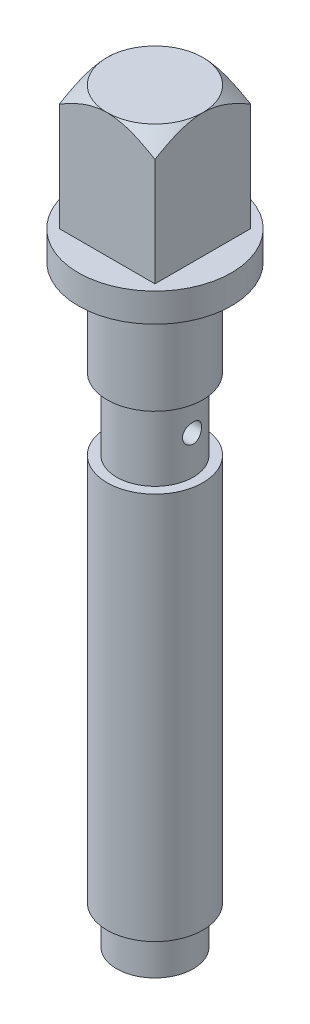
ISO-10303-21;
HEADER;
FILE_DESCRIPTION(('STEP AP214'),'2;1');
FILE_NAME('part.step','',(''),(''),'','','');
FILE_SCHEMA(('AUTOMOTIVE_DESIGN { 1 0 10303 214 1 1 1 1 }'));
ENDSEC;
DATA;
#1=APPLICATION_CONTEXT('core data for automotive mechanical design processes');
#2=APPLICATION_PROTOCOL_DEFINITION('international standard','automotive_design',2000,#1);
#3=PRODUCT_CONTEXT('',#1,'mechanical');
#4=PRODUCT('Part','Part','',(#3));
#5=PRODUCT_RELATED_PRODUCT_CATEGORY('part','',(#4));
#6=PRODUCT_DEFINITION_FORMATION('','',#4);
#7=PRODUCT_DEFINITION_CONTEXT('part definition',#1,'design');
#8=PRODUCT_DEFINITION('design','',#6,#7);
#9=PRODUCT_DEFINITION_SHAPE('','',#8);
#10=(LENGTH_UNIT() NAMED_UNIT(*) SI_UNIT(.MILLI.,.METRE.));
#11=(NAMED_UNIT(*) PLANE_ANGLE_UNIT() SI_UNIT($,.RADIAN.));
#12=(NAMED_UNIT(*) SI_UNIT($,.STERADIAN.) SOLID_ANGLE_UNIT());
#13=UNCERTAINTY_MEASURE_WITH_UNIT(LENGTH_MEASURE(1.E-05),#10,'distance_accuracy_value','');
#14=(GEOMETRIC_REPRESENTATION_CONTEXT(3) GLOBAL_UNCERTAINTY_ASSIGNED_CONTEXT((#13)) GLOBAL_UNIT_ASSIGNED_CONTEXT((#10,
#11,#12)) REPRESENTATION_CONTEXT('',''));
#15=CARTESIAN_POINT('',(0.,0.,0.));
#16=DIRECTION('',(0.,0.,1.));
#17=DIRECTION('',(1.,0.,0.));
#18=AXIS2_PLACEMENT_3D('',#15,#16,#17);
#19=CARTESIAN_POINT('',(5.,78.,-5.));
#20=DIRECTION('',(-1.,0.,0.));
#21=DIRECTION('',(0.,0.,1.));
#22=AXIS2_PLACEMENT_3D('',#19,#20,#21);
#23=PLANE('',#22);
#24=CARTESIAN_POINT('',(5.,68.7702588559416,15.1982390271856));
#25=CARTESIAN_POINT('',(5.,68.99079490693,14.9215460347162));
#26=CARTESIAN_POINT('',(5.,69.2109817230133,14.6445739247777));
#27=CARTESIAN_POINT('',(5.,69.6505101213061,14.0899565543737));
#28=CARTESIAN_POINT('',(5.,69.8698516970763,13.812311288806));
#29=CARTESIAN_POINT('',(5.,70.3076216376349,13.2561325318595));
#30=CARTESIAN_POINT('',(5.,70.5260496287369,12.9775987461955));
#31=CARTESIAN_POINT('',(5.,70.9617119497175,12.4195998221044));
#32=CARTESIAN_POINT('',(5.,71.1789462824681,12.1401346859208));
#33=CARTESIAN_POINT('',(5.,71.6139884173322,11.5774819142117));
#34=CARTESIAN_POINT('',(5.,71.8317827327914,11.2942838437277));
#35=CARTESIAN_POINT('',(5.,72.2655688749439,10.7265105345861));
#36=CARTESIAN_POINT('',(5.,72.4815607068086,10.4419352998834));
#37=CARTESIAN_POINT('',(5.,72.9112520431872,9.87115979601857));
#38=CARTESIAN_POINT('',(5.,73.1249520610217,9.58495991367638));
#39=CARTESIAN_POINT('',(5.,73.5495167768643,9.01046470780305));
#40=CARTESIAN_POINT('',(5.,73.7603815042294,8.72216940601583));
#41=CARTESIAN_POINT('',(5.,74.1146077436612,8.23138402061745));
#42=CARTESIAN_POINT('',(5.,74.2589172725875,8.02957850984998));
#43=CARTESIAN_POINT('',(5.,74.5453944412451,7.62445390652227));
#44=CARTESIAN_POINT('',(5.,74.6875621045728,7.42113483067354));
#45=CARTESIAN_POINT('',(5.,74.9693599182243,7.01257694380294));
#46=CARTESIAN_POINT('',(5.,75.1089886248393,6.80733713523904));
#47=CARTESIAN_POINT('',(5.,75.3850015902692,6.39468729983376));
#48=CARTESIAN_POINT('',(5.,75.5213859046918,6.18727731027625));
#49=CARTESIAN_POINT('',(5.,75.7900281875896,5.76991687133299));
#50=CARTESIAN_POINT('',(5.,75.9222878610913,5.55996752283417));
#51=CARTESIAN_POINT('',(5.,76.1816386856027,5.13686009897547));
#52=CARTESIAN_POINT('',(5.,76.3087293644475,4.92370173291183));
#53=CARTESIAN_POINT('',(5.,76.556100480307,4.49369278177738));
#54=CARTESIAN_POINT('',(5.,76.6763866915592,4.27684553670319));
#55=CARTESIAN_POINT('',(5.,76.9081538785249,3.83852099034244));
#56=CARTESIAN_POINT('',(5.,77.0196370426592,3.61704485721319));
#57=CARTESIAN_POINT('',(5.,77.2189336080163,3.19403753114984));
#58=CARTESIAN_POINT('',(5.,77.3079971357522,2.99310006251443));
#59=CARTESIAN_POINT('',(5.,77.4743093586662,2.5863054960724));
#60=CARTESIAN_POINT('',(5.,77.5515568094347,2.38044788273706));
#61=CARTESIAN_POINT('',(5.,77.6904961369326,1.96485418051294));
#62=CARTESIAN_POINT('',(5.,77.7522793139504,1.75514909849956));
#63=CARTESIAN_POINT('',(5.,77.8571911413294,1.33109634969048));
#64=CARTESIAN_POINT('',(5.,77.9003275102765,1.11675064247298));
#65=CARTESIAN_POINT('',(5.,77.9589438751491,0.722759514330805));
#66=CARTESIAN_POINT('',(5.,77.9779540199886,0.543642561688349));
#67=CARTESIAN_POINT('',(5.,77.9998354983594,0.184429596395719));
#68=CARTESIAN_POINT('',(5.,78.0027095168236,0.00433375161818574));
#69=CARTESIAN_POINT('',(5.,77.9921156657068,-0.355588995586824));
#70=CARTESIAN_POINT('',(5.,77.978627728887,-0.535415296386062));
#71=CARTESIAN_POINT('',(5.,77.936173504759,-0.893230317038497));
#72=CARTESIAN_POINT('',(5.,77.9072035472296,-1.07121859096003));
#73=CARTESIAN_POINT('',(5.,77.8197601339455,-1.50158385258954));
#74=CARTESIAN_POINT('',(5.,77.7539250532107,-1.75245979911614));
#75=CARTESIAN_POINT('',(5.,77.5997987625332,-2.24719652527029));
#76=CARTESIAN_POINT('',(5.,77.5114915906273,-2.49105218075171));
#77=CARTESIAN_POINT('',(5.,77.365756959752,-2.85330227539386));
#78=CARTESIAN_POINT('',(5.,77.3145714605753,-2.9742747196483));
#79=CARTESIAN_POINT('',(5.,77.2084614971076,-3.21457428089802));
#80=CARTESIAN_POINT('',(5.,77.1535369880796,-3.33390137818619));
#81=CARTESIAN_POINT('',(5.,77.0405051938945,-3.57097684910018));
#82=CARTESIAN_POINT('',(5.,76.9823990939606,-3.68872579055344));
#83=CARTESIAN_POINT('',(5.,76.8634311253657,-3.9228121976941));
#84=CARTESIAN_POINT('',(5.,76.8025693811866,-4.03914972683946));
#85=CARTESIAN_POINT('',(5.,76.5982841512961,-4.42010551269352));
#86=CARTESIAN_POINT('',(5.,76.4498235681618,-4.68202621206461));
#87=CARTESIAN_POINT('',(5.,76.1439447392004,-5.20060577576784));
#88=CARTESIAN_POINT('',(5.,75.9865242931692,-5.45726332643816));
#89=CARTESIAN_POINT('',(5.,75.6649423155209,-5.96660078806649));
#90=CARTESIAN_POINT('',(5.,75.5007753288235,-6.21927724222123));
#91=CARTESIAN_POINT('',(5.,75.1674653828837,-6.72127926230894));
#92=CARTESIAN_POINT('',(5.,74.9983228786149,-6.97060513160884));
#93=CARTESIAN_POINT('',(5.,74.6556032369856,-7.46744999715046));
#94=CARTESIAN_POINT('',(5.,74.4820128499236,-7.71495983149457));
#95=CARTESIAN_POINT('',(5.,74.1317912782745,-8.20782145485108));
#96=CARTESIAN_POINT('',(5.,73.9551600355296,-8.4531732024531));
#97=CARTESIAN_POINT('',(5.,73.5995587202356,-8.94199727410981));
#98=CARTESIAN_POINT('',(5.,73.4205897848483,-9.18547042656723));
#99=CARTESIAN_POINT('',(5.,73.0606889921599,-9.67096254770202));
#100=CARTESIAN_POINT('',(5.,72.879757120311,-9.91298150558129));
#101=CARTESIAN_POINT('',(5.,72.3765519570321,-10.5814474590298));
#102=CARTESIAN_POINT('',(5.,72.0525743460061,-11.0066111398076));
#103=CARTESIAN_POINT('',(5.,71.4009604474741,-11.8542074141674));
#104=CARTESIAN_POINT('',(5.,71.073323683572,-12.2766396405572));
#105=CARTESIAN_POINT('',(5.,70.4175726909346,-13.116543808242));
#106=CARTESIAN_POINT('',(5.,70.0894766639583,-13.5340299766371));
#107=CARTESIAN_POINT('',(5.,69.4312561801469,-14.367290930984));
#108=CARTESIAN_POINT('',(5.,69.1011320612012,-14.7830659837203));
#109=CARTESIAN_POINT('',(5.,68.7702588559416,-15.1982390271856));
#110=B_SPLINE_CURVE_WITH_KNOTS('',3,(#24,#25,#26,#27,#28,#29,#30,#31,#32,#33,#34,#35,#36,#37,
#38,#39,#40,#41,#42,#43,#44,#45,#46,#47,#48,#49,#50,#51,#52,#53,#54,#55,#56,#57,#58,#59,#60,#61,
#62,#63,#64,#65,#66,#67,#68,#69,#70,#71,#72,#73,#74,#75,#76,#77,#78,#79,#80,#81,#82,#83,#84,#85,
#86,#87,#88,#89,#90,#91,#92,#93,#94,#95,#96,#97,#98,#99,#100,#101,#102,#103,#104,#105,#106,#107,
#108,#109),.UNSPECIFIED.,.F.,.F.,(4,2,2,2,2,2,2,2,2,2,2,2,2,2,2,2,2,2,2,2,2,2,2,2,2,2,2,2,2,2,2,
2,2,2,2,2,2,2,2,2,2,2,4),(0.,1.06148845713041,2.12298498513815,3.18487995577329,
4.24677237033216,5.31854997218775,6.39032449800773,7.46185373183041,8.53337186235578,
9.27764330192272,10.0219065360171,10.7665805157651,11.5112417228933,12.2555909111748,
13.0000079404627,13.7437834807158,14.487373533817,15.1464592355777,15.8056143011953,
16.4607807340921,17.11567570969,17.6553711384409,18.1949767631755,18.7352448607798,
19.2756410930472,20.0523146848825,20.8295414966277,21.2235583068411,21.61757983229,
22.0114555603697,22.4053135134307,23.3082380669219,24.2113853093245,25.1152777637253,
26.019087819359,26.9260059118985,27.8329413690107,28.7394509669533,29.6459672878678,
31.2495362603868,32.8533164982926,34.4462545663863,36.0389340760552),.UNSPECIFIED.);
#111=CARTESIAN_POINT('',(5.,76.2621677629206,5.));
#112=VERTEX_POINT('',#111);
#113=CARTESIAN_POINT('',(5.,78.,0.));
#114=VERTEX_POINT('',#113);
#115=EDGE_CURVE('E105',#112,#114,#110,.T.);
#116=ORIENTED_EDGE('',*,*,#115,.F.);
#117=DIRECTION('',(0.,-1.,0.));
#118=VECTOR('',#117,1.);
#119=CARTESIAN_POINT('',(5.,78.,5.));
#120=LINE('',#119,#118);
#121=CARTESIAN_POINT('',(5.,65.,5.));
#122=VERTEX_POINT('',#121);
#123=EDGE_CURVE('E72',#112,#122,#120,.T.);
#124=ORIENTED_EDGE('',*,*,#123,.T.);
#125=DIRECTION('',(0.,0.,-1.));
#126=VECTOR('',#125,1.);
#127=CARTESIAN_POINT('',(5.,65.,-5.));
#128=LINE('',#127,#126);
#129=CARTESIAN_POINT('',(5.,65.,-5.));
#130=VERTEX_POINT('',#129);
#131=EDGE_CURVE('E113',#122,#130,#128,.T.);
#132=ORIENTED_EDGE('',*,*,#131,.T.);
#133=DIRECTION('',(0.,-1.,0.));
#134=VECTOR('',#133,1.);
#135=CARTESIAN_POINT('',(5.,78.,-5.));
#136=LINE('',#135,#134);
#137=CARTESIAN_POINT('',(5.,76.2621677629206,-5.));
#138=VERTEX_POINT('',#137);
#139=EDGE_CURVE('E126',#138,#130,#136,.T.);
#140=ORIENTED_EDGE('',*,*,#139,.F.);
#141=EDGE_CURVE('E114',#114,#138,#110,.T.);
#142=ORIENTED_EDGE('',*,*,#141,.F.);
#143=EDGE_LOOP('',(#116,#124,#132,#140,#142));
#144=FACE_BOUND('',#143,.T.);
#145=ADVANCED_FACE('F48',(#144),#23,.F.);
#146=CARTESIAN_POINT('',(-5.,78.,-5.));
#147=DIRECTION('',(0.,0.,1.));
#148=DIRECTION('',(1.,0.,0.));
#149=AXIS2_PLACEMENT_3D('',#146,#147,#148);
#150=PLANE('',#149);
#151=CARTESIAN_POINT('',(15.1982390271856,68.7702588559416,-5.));
#152=CARTESIAN_POINT('',(14.9215460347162,68.99079490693,-5.));
#153=CARTESIAN_POINT('',(14.6445739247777,69.2109817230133,-5.));
#154=CARTESIAN_POINT('',(14.0899565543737,69.6505101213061,-5.));
#155=CARTESIAN_POINT('',(13.812311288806,69.8698516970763,-5.));
#156=CARTESIAN_POINT('',(13.2561325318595,70.3076216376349,-5.));
#157=CARTESIAN_POINT('',(12.9775987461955,70.5260496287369,-5.));
#158=CARTESIAN_POINT('',(12.4195998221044,70.9617119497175,-5.));
#159=CARTESIAN_POINT('',(12.1401346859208,71.1789462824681,-5.));
#160=CARTESIAN_POINT('',(11.5774819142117,71.6139884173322,-5.));
#161=CARTESIAN_POINT('',(11.2942838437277,71.8317827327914,-5.));
#162=CARTESIAN_POINT('',(10.7265105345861,72.2655688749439,-5.));
#163=CARTESIAN_POINT('',(10.4419352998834,72.4815607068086,-5.));
#164=CARTESIAN_POINT('',(9.87115979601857,72.9112520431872,-5.));
#165=CARTESIAN_POINT('',(9.58495991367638,73.1249520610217,-5.));
#166=CARTESIAN_POINT('',(9.01046470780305,73.5495167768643,-5.));
#167=CARTESIAN_POINT('',(8.72216940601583,73.7603815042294,-5.));
#168=CARTESIAN_POINT('',(8.23138402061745,74.1146077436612,-5.));
#169=CARTESIAN_POINT('',(8.02957850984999,74.2589172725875,-5.));
#170=CARTESIAN_POINT('',(7.62445390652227,74.5453944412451,-5.));
#171=CARTESIAN_POINT('',(7.42113483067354,74.6875621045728,-5.));
#172=CARTESIAN_POINT('',(7.01257694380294,74.9693599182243,-5.));
#173=CARTESIAN_POINT('',(6.80733713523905,75.1089886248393,-5.));
#174=CARTESIAN_POINT('',(6.39468729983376,75.3850015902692,-5.));
#175=CARTESIAN_POINT('',(6.18727731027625,75.5213859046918,-5.));
#176=CARTESIAN_POINT('',(5.769916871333,75.7900281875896,-5.));
#177=CARTESIAN_POINT('',(5.55996752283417,75.9222878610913,-5.));
#178=CARTESIAN_POINT('',(5.13686009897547,76.1816386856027,-5.));
#179=CARTESIAN_POINT('',(4.92370173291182,76.3087293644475,-5.));
#180=CARTESIAN_POINT('',(4.49369278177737,76.556100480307,-5.));
#181=CARTESIAN_POINT('',(4.27684553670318,76.6763866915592,-5.));
#182=CARTESIAN_POINT('',(3.83852099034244,76.9081538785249,-5.));
#183=CARTESIAN_POINT('',(3.61704485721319,77.0196370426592,-5.));
#184=CARTESIAN_POINT('',(3.19403753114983,77.2189336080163,-5.));
#185=CARTESIAN_POINT('',(2.99310006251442,77.3079971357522,-5.));
#186=CARTESIAN_POINT('',(2.58630549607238,77.4743093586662,-5.));
#187=CARTESIAN_POINT('',(2.38044788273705,77.5515568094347,-5.));
#188=CARTESIAN_POINT('',(1.96485418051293,77.6904961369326,-5.));
#189=CARTESIAN_POINT('',(1.75514909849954,77.7522793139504,-5.));
#190=CARTESIAN_POINT('',(1.33109634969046,77.8571911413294,-5.));
#191=CARTESIAN_POINT('',(1.11675064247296,77.9003275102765,-5.));
#192=CARTESIAN_POINT('',(0.722759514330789,77.9589438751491,-5.));
#193=CARTESIAN_POINT('',(0.543642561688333,77.9779540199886,-5.));
#194=CARTESIAN_POINT('',(0.184429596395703,77.9998354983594,-5.));
#195=CARTESIAN_POINT('',(0.0043337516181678,78.0027095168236,-5.));
#196=CARTESIAN_POINT('',(-0.355588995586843,77.9921156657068,-5.));
#197=CARTESIAN_POINT('',(-0.535415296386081,77.978627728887,-5.));
#198=CARTESIAN_POINT('',(-0.893230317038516,77.936173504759,-5.));
#199=CARTESIAN_POINT('',(-1.07121859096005,77.9072035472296,-5.));
#200=CARTESIAN_POINT('',(-1.50158385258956,77.8197601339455,-5.));
#201=CARTESIAN_POINT('',(-1.75245979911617,77.7539250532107,-5.));
#202=CARTESIAN_POINT('',(-2.24719652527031,77.5997987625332,-5.));
#203=CARTESIAN_POINT('',(-2.49105218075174,77.5114915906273,-5.));
#204=CARTESIAN_POINT('',(-2.85330227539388,77.365756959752,-5.));
#205=CARTESIAN_POINT('',(-2.97427471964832,77.3145714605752,-5.));
#206=CARTESIAN_POINT('',(-3.21457428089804,77.2084614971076,-5.));
#207=CARTESIAN_POINT('',(-3.33390137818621,77.1535369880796,-5.));
#208=CARTESIAN_POINT('',(-3.5709768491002,77.0405051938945,-5.));
#209=CARTESIAN_POINT('',(-3.68872579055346,76.9823990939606,-5.));
#210=CARTESIAN_POINT('',(-3.92281219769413,76.8634311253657,-5.));
#211=CARTESIAN_POINT('',(-4.03914972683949,76.8025693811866,-5.));
#212=CARTESIAN_POINT('',(-4.42010551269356,76.5982841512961,-5.));
#213=CARTESIAN_POINT('',(-4.68202621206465,76.4498235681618,-5.));
#214=CARTESIAN_POINT('',(-5.20060577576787,76.1439447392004,-5.));
#215=CARTESIAN_POINT('',(-5.45726332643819,75.9865242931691,-5.));
#216=CARTESIAN_POINT('',(-5.96660078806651,75.6649423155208,-5.));
#217=CARTESIAN_POINT('',(-6.21927724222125,75.5007753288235,-5.));
#218=CARTESIAN_POINT('',(-6.72127926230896,75.1674653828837,-5.));
#219=CARTESIAN_POINT('',(-6.97060513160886,74.9983228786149,-5.));
#220=CARTESIAN_POINT('',(-7.46744999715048,74.6556032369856,-5.));
#221=CARTESIAN_POINT('',(-7.71495983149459,74.4820128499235,-5.));
#222=CARTESIAN_POINT('',(-8.2078214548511,74.1317912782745,-5.));
#223=CARTESIAN_POINT('',(-8.45317320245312,73.9551600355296,-5.));
#224=CARTESIAN_POINT('',(-8.94199727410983,73.5995587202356,-5.));
#225=CARTESIAN_POINT('',(-9.18547042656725,73.4205897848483,-5.));
#226=CARTESIAN_POINT('',(-9.67096254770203,73.0606889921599,-5.));
#227=CARTESIAN_POINT('',(-9.91298150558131,72.879757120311,-5.));
#228=CARTESIAN_POINT('',(-10.5814474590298,72.3765519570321,-5.));
#229=CARTESIAN_POINT('',(-11.0066111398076,72.0525743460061,-5.));
#230=CARTESIAN_POINT('',(-11.8542074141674,71.4009604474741,-5.));
#231=CARTESIAN_POINT('',(-12.2766396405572,71.073323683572,-5.));
#232=CARTESIAN_POINT('',(-13.116543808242,70.4175726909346,-5.));
#233=CARTESIAN_POINT('',(-13.5340299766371,70.0894766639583,-5.));
#234=CARTESIAN_POINT('',(-14.367290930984,69.4312561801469,-5.));
#235=CARTESIAN_POINT('',(-14.7830659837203,69.1011320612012,-5.));
#236=CARTESIAN_POINT('',(-15.1982390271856,68.7702588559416,-5.));
#237=B_SPLINE_CURVE_WITH_KNOTS('',3,(#151,#152,#153,#154,#155,#156,#157,#158,#159,#160,#161,
#162,#163,#164,#165,#166,#167,#168,#169,#170,#171,#172,#173,#174,#175,#176,#177,#178,#179,#180,
#181,#182,#183,#184,#185,#186,#187,#188,#189,#190,#191,#192,#193,#194,#195,#196,#197,#198,#199,
#200,#201,#202,#203,#204,#205,#206,#207,#208,#209,#210,#211,#212,#213,#214,#215,#216,#217,#218,
#219,#220,#221,#222,#223,#224,#225,#226,#227,#228,#229,#230,#231,#232,#233,#234,#235,#236),
.UNSPECIFIED.,.F.,.F.,(4,2,2,2,2,2,2,2,2,2,2,2,2,2,2,2,2,2,2,2,2,2,2,2,2,2,2,2,2,2,2,2,2,2,2,2,
2,2,2,2,2,2,4),(0.,1.06148845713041,2.12298498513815,3.18487995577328,4.24677237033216,
5.31854997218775,6.39032449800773,7.46185373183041,8.53337186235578,9.27764330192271,
10.0219065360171,10.7665805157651,11.5112417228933,12.2555909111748,13.0000079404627,
13.7437834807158,14.487373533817,15.1464592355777,15.8056143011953,16.4607807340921,
17.11567570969,17.6553711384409,18.1949767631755,18.7352448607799,19.2756410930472,
20.0523146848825,20.8295414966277,21.2235583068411,21.61757983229,22.0114555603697,
22.4053135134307,23.3082380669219,24.2113853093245,25.1152777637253,26.019087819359,
26.9260059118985,27.8329413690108,28.7394509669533,29.6459672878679,31.2495362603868,
32.8533164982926,34.4462545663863,36.0389340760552),.UNSPECIFIED.);
#238=CARTESIAN_POINT('',(0.,78.,-5.));
#239=VERTEX_POINT('',#238);
#240=EDGE_CURVE('E119',#138,#239,#237,.T.);
#241=ORIENTED_EDGE('',*,*,#240,.F.);
#242=ORIENTED_EDGE('',*,*,#139,.T.);
#243=DIRECTION('',(-1.,0.,0.));
#244=VECTOR('',#243,1.);
#245=CARTESIAN_POINT('',(-5.,65.,-5.));
#246=LINE('',#245,#244);
#247=CARTESIAN_POINT('',(-5.,65.,-5.));
#248=VERTEX_POINT('',#247);
#249=EDGE_CURVE('E302',#130,#248,#246,.T.);
#250=ORIENTED_EDGE('',*,*,#249,.T.);
#251=DIRECTION('',(0.,-1.,0.));
#252=VECTOR('',#251,1.);
#253=CARTESIAN_POINT('',(-5.,78.,-5.));
#254=LINE('',#253,#252);
#255=CARTESIAN_POINT('',(-5.,76.2621677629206,-5.));
#256=VERTEX_POINT('',#255);
#257=EDGE_CURVE('E185',#256,#248,#254,.T.);
#258=ORIENTED_EDGE('',*,*,#257,.F.);
#259=EDGE_CURVE('E129',#239,#256,#237,.T.);
#260=ORIENTED_EDGE('',*,*,#259,.F.);
#261=EDGE_LOOP('',(#241,#242,#250,#258,#260));
#262=FACE_BOUND('',#261,.T.);
#263=ADVANCED_FACE('F173',(#262),#150,.F.);
#264=CARTESIAN_POINT('',(-5.,78.,-5.));
#265=DIRECTION('',(1.,0.,0.));
#266=DIRECTION('',(0.,0.,-1.));
#267=AXIS2_PLACEMENT_3D('',#264,#265,#266);
#268=PLANE('',#267);
#269=CARTESIAN_POINT('',(-5.,68.7702588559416,-15.1982390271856));
#270=CARTESIAN_POINT('',(-5.,68.99079490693,-14.9215460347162));
#271=CARTESIAN_POINT('',(-5.,69.2109817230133,-14.6445739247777));
#272=CARTESIAN_POINT('',(-5.,69.6505101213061,-14.0899565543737));
#273=CARTESIAN_POINT('',(-5.,69.8698516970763,-13.812311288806));
#274=CARTESIAN_POINT('',(-5.,70.3076216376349,-13.2561325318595));
#275=CARTESIAN_POINT('',(-5.,70.5260496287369,-12.9775987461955));
#276=CARTESIAN_POINT('',(-5.,70.9617119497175,-12.4195998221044));
#277=CARTESIAN_POINT('',(-5.,71.1789462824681,-12.1401346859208));
#278=CARTESIAN_POINT('',(-5.,71.6139884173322,-11.5774819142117));
#279=CARTESIAN_POINT('',(-5.,71.8317827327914,-11.2942838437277));
#280=CARTESIAN_POINT('',(-5.,72.2655688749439,-10.7265105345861));
#281=CARTESIAN_POINT('',(-5.,72.4815607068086,-10.4419352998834));
#282=CARTESIAN_POINT('',(-5.,72.9112520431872,-9.87115979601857));
#283=CARTESIAN_POINT('',(-5.,73.1249520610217,-9.58495991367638));
#284=CARTESIAN_POINT('',(-5.,73.5495167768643,-9.01046470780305));
#285=CARTESIAN_POINT('',(-5.,73.7603815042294,-8.72216940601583));
#286=CARTESIAN_POINT('',(-5.,74.1146077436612,-8.23138402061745));
#287=CARTESIAN_POINT('',(-5.,74.2589172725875,-8.02957850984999));
#288=CARTESIAN_POINT('',(-5.,74.5453944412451,-7.62445390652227));
#289=CARTESIAN_POINT('',(-5.,74.6875621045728,-7.42113483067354));
#290=CARTESIAN_POINT('',(-5.,74.9693599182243,-7.01257694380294));
#291=CARTESIAN_POINT('',(-5.,75.1089886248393,-6.80733713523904));
#292=CARTESIAN_POINT('',(-5.,75.3850015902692,-6.39468729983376));
#293=CARTESIAN_POINT('',(-5.,75.5213859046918,-6.18727731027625));
#294=CARTESIAN_POINT('',(-5.,75.7900281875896,-5.76991687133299));
#295=CARTESIAN_POINT('',(-5.,75.9222878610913,-5.55996752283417));
#296=CARTESIAN_POINT('',(-5.,76.1816386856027,-5.13686009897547));
#297=CARTESIAN_POINT('',(-5.,76.3087293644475,-4.92370173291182));
#298=CARTESIAN_POINT('',(-5.,76.556100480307,-4.49369278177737));
#299=CARTESIAN_POINT('',(-5.,76.6763866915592,-4.27684553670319));
#300=CARTESIAN_POINT('',(-5.,76.9081538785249,-3.83852099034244));
#301=CARTESIAN_POINT('',(-5.,77.0196370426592,-3.61704485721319));
#302=CARTESIAN_POINT('',(-5.,77.2189336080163,-3.19403753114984));
#303=CARTESIAN_POINT('',(-5.,77.3079971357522,-2.99310006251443));
#304=CARTESIAN_POINT('',(-5.,77.4743093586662,-2.5863054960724));
#305=CARTESIAN_POINT('',(-5.,77.5515568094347,-2.38044788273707));
#306=CARTESIAN_POINT('',(-5.,77.6904961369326,-1.96485418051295));
#307=CARTESIAN_POINT('',(-5.,77.7522793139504,-1.75514909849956));
#308=CARTESIAN_POINT('',(-5.,77.8571911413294,-1.33109634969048));
#309=CARTESIAN_POINT('',(-5.,77.9003275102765,-1.11675064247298));
#310=CARTESIAN_POINT('',(-5.,77.9589438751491,-0.722759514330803));
#311=CARTESIAN_POINT('',(-5.,77.9779540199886,-0.543642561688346));
#312=CARTESIAN_POINT('',(-5.,77.9998354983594,-0.184429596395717));
#313=CARTESIAN_POINT('',(-5.,78.0027095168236,-0.00433375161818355));
#314=CARTESIAN_POINT('',(-5.,77.9921156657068,0.355588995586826));
#315=CARTESIAN_POINT('',(-5.,77.978627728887,0.535415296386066));
#316=CARTESIAN_POINT('',(-5.,77.936173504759,0.8932303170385));
#317=CARTESIAN_POINT('',(-5.,77.9072035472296,1.07121859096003));
#318=CARTESIAN_POINT('',(-5.,77.8197601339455,1.50158385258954));
#319=CARTESIAN_POINT('',(-5.,77.7539250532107,1.75245979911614));
#320=CARTESIAN_POINT('',(-5.,77.5997987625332,2.24719652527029));
#321=CARTESIAN_POINT('',(-5.,77.5114915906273,2.49105218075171));
#322=CARTESIAN_POINT('',(-5.,77.365756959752,2.85330227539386));
#323=CARTESIAN_POINT('',(-5.,77.3145714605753,2.9742747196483));
#324=CARTESIAN_POINT('',(-5.,77.2084614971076,3.21457428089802));
#325=CARTESIAN_POINT('',(-5.,77.1535369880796,3.33390137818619));
#326=CARTESIAN_POINT('',(-5.,77.0405051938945,3.57097684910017));
#327=CARTESIAN_POINT('',(-5.,76.9823990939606,3.68872579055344));
#328=CARTESIAN_POINT('',(-5.,76.8634311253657,3.9228121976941));
#329=CARTESIAN_POINT('',(-5.,76.8025693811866,4.03914972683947));
#330=CARTESIAN_POINT('',(-5.,76.5982841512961,4.42010551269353));
#331=CARTESIAN_POINT('',(-5.,76.4498235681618,4.68202621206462));
#332=CARTESIAN_POINT('',(-5.,76.1439447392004,5.20060577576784));
#333=CARTESIAN_POINT('',(-5.,75.9865242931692,5.45726332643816));
#334=CARTESIAN_POINT('',(-5.,75.6649423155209,5.96660078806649));
#335=CARTESIAN_POINT('',(-5.,75.5007753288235,6.21927724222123));
#336=CARTESIAN_POINT('',(-5.,75.1674653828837,6.72127926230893));
#337=CARTESIAN_POINT('',(-5.,74.9983228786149,6.97060513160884));
#338=CARTESIAN_POINT('',(-5.,74.6556032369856,7.46744999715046));
#339=CARTESIAN_POINT('',(-5.,74.4820128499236,7.71495983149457));
#340=CARTESIAN_POINT('',(-5.,74.1317912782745,8.20782145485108));
#341=CARTESIAN_POINT('',(-5.,73.9551600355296,8.4531732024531));
#342=CARTESIAN_POINT('',(-5.,73.5995587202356,8.94199727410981));
#343=CARTESIAN_POINT('',(-5.,73.4205897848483,9.18547042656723));
#344=CARTESIAN_POINT('',(-5.,73.0606889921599,9.67096254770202));
#345=CARTESIAN_POINT('',(-5.,72.879757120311,9.91298150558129));
#346=CARTESIAN_POINT('',(-5.,72.3765519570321,10.5814474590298));
#347=CARTESIAN_POINT('',(-5.,72.0525743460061,11.0066111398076));
#348=CARTESIAN_POINT('',(-5.,71.4009604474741,11.8542074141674));
#349=CARTESIAN_POINT('',(-5.,71.073323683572,12.2766396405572));
#350=CARTESIAN_POINT('',(-5.,70.4175726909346,13.116543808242));
#351=CARTESIAN_POINT('',(-5.,70.0894766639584,13.5340299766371));
#352=CARTESIAN_POINT('',(-5.,69.4312561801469,14.367290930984));
#353=CARTESIAN_POINT('',(-5.,69.1011320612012,14.7830659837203));
#354=CARTESIAN_POINT('',(-5.,68.7702588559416,15.1982390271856));
#355=B_SPLINE_CURVE_WITH_KNOTS('',3,(#269,#270,#271,#272,#273,#274,#275,#276,#277,#278,#279,
#280,#281,#282,#283,#284,#285,#286,#287,#288,#289,#290,#291,#292,#293,#294,#295,#296,#297,#298,
#299,#300,#301,#302,#303,#304,#305,#306,#307,#308,#309,#310,#311,#312,#313,#314,#315,#316,#317,
#318,#319,#320,#321,#322,#323,#324,#325,#326,#327,#328,#329,#330,#331,#332,#333,#334,#335,#336,
#337,#338,#339,#340,#341,#342,#343,#344,#345,#346,#347,#348,#349,#350,#351,#352,#353,#354),
.UNSPECIFIED.,.F.,.F.,(4,2,2,2,2,2,2,2,2,2,2,2,2,2,2,2,2,2,2,2,2,2,2,2,2,2,2,2,2,2,2,2,2,2,2,2,
2,2,2,2,2,2,4),(0.,1.06148845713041,2.12298498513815,3.18487995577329,4.24677237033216,
5.31854997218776,6.39032449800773,7.46185373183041,8.53337186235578,9.27764330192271,
10.0219065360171,10.7665805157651,11.5112417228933,12.2555909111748,13.0000079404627,
13.7437834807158,14.487373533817,15.1464592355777,15.8056143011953,16.4607807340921,
17.11567570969,17.6553711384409,18.1949767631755,18.7352448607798,19.2756410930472,
20.0523146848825,20.8295414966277,21.2235583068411,21.61757983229,22.0114555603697,
22.4053135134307,23.3082380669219,24.2113853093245,25.1152777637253,26.019087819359,
26.9260059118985,27.8329413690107,28.7394509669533,29.6459672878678,31.2495362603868,
32.8533164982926,34.4462545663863,36.0389340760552),.UNSPECIFIED.);
#356=CARTESIAN_POINT('',(-5.,78.,0.));
#357=VERTEX_POINT('',#356);
#358=EDGE_CURVE('E167',#256,#357,#355,.T.);
#359=ORIENTED_EDGE('',*,*,#358,.F.);
#360=ORIENTED_EDGE('',*,*,#257,.T.);
#361=DIRECTION('',(0.,0.,1.));
#362=VECTOR('',#361,1.);
#363=CARTESIAN_POINT('',(-5.,65.,-5.));
#364=LINE('',#363,#362);
#365=CARTESIAN_POINT('',(-5.,65.,5.));
#366=VERTEX_POINT('',#365);
#367=EDGE_CURVE('E201',#248,#366,#364,.T.);
#368=ORIENTED_EDGE('',*,*,#367,.T.);
#369=DIRECTION('',(0.,-1.,0.));
#370=VECTOR('',#369,1.);
#371=CARTESIAN_POINT('',(-5.,78.,5.));
#372=LINE('',#371,#370);
#373=CARTESIAN_POINT('',(-5.,76.2621677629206,5.));
#374=VERTEX_POINT('',#373);
#375=EDGE_CURVE('E199',#374,#366,#372,.T.);
#376=ORIENTED_EDGE('',*,*,#375,.F.);
#377=EDGE_CURVE('E160',#357,#374,#355,.T.);
#378=ORIENTED_EDGE('',*,*,#377,.F.);
#379=EDGE_LOOP('',(#359,#360,#368,#376,#378));
#380=FACE_BOUND('',#379,.T.);
#381=ADVANCED_FACE('F169',(#380),#268,.F.);
#382=CARTESIAN_POINT('',(-5.,78.,5.));
#383=DIRECTION('',(0.,0.,-1.));
#384=DIRECTION('',(-1.,0.,0.));
#385=AXIS2_PLACEMENT_3D('',#382,#383,#384);
#386=PLANE('',#385);
#387=CARTESIAN_POINT('',(-15.1982390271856,68.7702588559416,5.));
#388=CARTESIAN_POINT('',(-14.9215460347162,68.99079490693,5.));
#389=CARTESIAN_POINT('',(-14.6445739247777,69.2109817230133,5.));
#390=CARTESIAN_POINT('',(-14.0899565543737,69.6505101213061,5.));
#391=CARTESIAN_POINT('',(-13.812311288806,69.8698516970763,5.));
#392=CARTESIAN_POINT('',(-13.2561325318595,70.3076216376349,5.));
#393=CARTESIAN_POINT('',(-12.9775987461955,70.5260496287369,5.));
#394=CARTESIAN_POINT('',(-12.4195998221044,70.9617119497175,5.));
#395=CARTESIAN_POINT('',(-12.1401346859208,71.1789462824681,5.));
#396=CARTESIAN_POINT('',(-11.5774819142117,71.6139884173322,5.));
#397=CARTESIAN_POINT('',(-11.2942838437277,71.8317827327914,5.));
#398=CARTESIAN_POINT('',(-10.7265105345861,72.2655688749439,5.));
#399=CARTESIAN_POINT('',(-10.4419352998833,72.4815607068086,5.));
#400=CARTESIAN_POINT('',(-9.87115979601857,72.9112520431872,5.));
#401=CARTESIAN_POINT('',(-9.58495991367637,73.1249520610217,5.));
#402=CARTESIAN_POINT('',(-9.01046470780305,73.5495167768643,5.));
#403=CARTESIAN_POINT('',(-8.72216940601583,73.7603815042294,5.));
#404=CARTESIAN_POINT('',(-8.23138402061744,74.1146077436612,5.));
#405=CARTESIAN_POINT('',(-8.02957850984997,74.2589172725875,5.));
#406=CARTESIAN_POINT('',(-7.62445390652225,74.5453944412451,5.));
#407=CARTESIAN_POINT('',(-7.42113483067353,74.6875621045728,5.));
#408=CARTESIAN_POINT('',(-7.01257694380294,74.9693599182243,5.));
#409=CARTESIAN_POINT('',(-6.80733713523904,75.1089886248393,5.));
#410=CARTESIAN_POINT('',(-6.39468729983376,75.3850015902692,5.));
#411=CARTESIAN_POINT('',(-6.18727731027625,75.5213859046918,5.));
#412=CARTESIAN_POINT('',(-5.769916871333,75.7900281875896,5.));
#413=CARTESIAN_POINT('',(-5.55996752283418,75.9222878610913,5.));
#414=CARTESIAN_POINT('',(-5.13686009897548,76.1816386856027,5.));
#415=CARTESIAN_POINT('',(-4.92370173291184,76.3087293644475,5.));
#416=CARTESIAN_POINT('',(-4.49369278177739,76.556100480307,5.));
#417=CARTESIAN_POINT('',(-4.2768455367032,76.6763866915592,5.));
#418=CARTESIAN_POINT('',(-3.83852099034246,76.9081538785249,5.));
#419=CARTESIAN_POINT('',(-3.61704485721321,77.0196370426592,5.));
#420=CARTESIAN_POINT('',(-3.19403753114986,77.2189336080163,5.));
#421=CARTESIAN_POINT('',(-2.99310006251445,77.3079971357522,5.));
#422=CARTESIAN_POINT('',(-2.58630549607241,77.4743093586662,5.));
#423=CARTESIAN_POINT('',(-2.38044788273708,77.5515568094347,5.));
#424=CARTESIAN_POINT('',(-1.96485418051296,77.6904961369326,5.));
#425=CARTESIAN_POINT('',(-1.75514909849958,77.7522793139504,5.));
#426=CARTESIAN_POINT('',(-1.3310963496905,77.8571911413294,5.));
#427=CARTESIAN_POINT('',(-1.116750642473,77.9003275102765,5.));
#428=CARTESIAN_POINT('',(-0.722759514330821,77.9589438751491,5.));
#429=CARTESIAN_POINT('',(-0.543642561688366,77.9779540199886,5.));
#430=CARTESIAN_POINT('',(-0.184429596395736,77.9998354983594,5.));
#431=CARTESIAN_POINT('',(-0.00433375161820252,78.0027095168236,5.));
#432=CARTESIAN_POINT('',(0.355588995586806,77.9921156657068,5.));
#433=CARTESIAN_POINT('',(0.535415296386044,77.978627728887,5.));
#434=CARTESIAN_POINT('',(0.893230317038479,77.936173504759,5.));
#435=CARTESIAN_POINT('',(1.07121859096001,77.9072035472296,5.));
#436=CARTESIAN_POINT('',(1.50158385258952,77.8197601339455,5.));
#437=CARTESIAN_POINT('',(1.75245979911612,77.7539250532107,5.));
#438=CARTESIAN_POINT('',(2.24719652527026,77.5997987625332,5.));
#439=CARTESIAN_POINT('',(2.49105218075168,77.5114915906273,5.));
#440=CARTESIAN_POINT('',(2.85330227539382,77.365756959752,5.));
#441=CARTESIAN_POINT('',(2.97427471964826,77.3145714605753,5.));
#442=CARTESIAN_POINT('',(3.21457428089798,77.2084614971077,5.));
#443=CARTESIAN_POINT('',(3.33390137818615,77.1535369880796,5.));
#444=CARTESIAN_POINT('',(3.57097684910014,77.0405051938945,5.));
#445=CARTESIAN_POINT('',(3.68872579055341,76.9823990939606,5.));
#446=CARTESIAN_POINT('',(3.92281219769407,76.8634311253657,5.));
#447=CARTESIAN_POINT('',(4.03914972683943,76.8025693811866,5.));
#448=CARTESIAN_POINT('',(4.4201055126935,76.5982841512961,5.));
#449=CARTESIAN_POINT('',(4.68202621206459,76.4498235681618,5.));
#450=CARTESIAN_POINT('',(5.20060577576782,76.1439447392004,5.));
#451=CARTESIAN_POINT('',(5.45726332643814,75.9865242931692,5.));
#452=CARTESIAN_POINT('',(5.96660078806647,75.6649423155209,5.));
#453=CARTESIAN_POINT('',(6.21927724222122,75.5007753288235,5.));
#454=CARTESIAN_POINT('',(6.72127926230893,75.1674653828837,5.));
#455=CARTESIAN_POINT('',(6.97060513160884,74.9983228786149,5.));
#456=CARTESIAN_POINT('',(7.46744999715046,74.6556032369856,5.));
#457=CARTESIAN_POINT('',(7.71495983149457,74.4820128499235,5.));
#458=CARTESIAN_POINT('',(8.20782145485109,74.1317912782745,5.));
#459=CARTESIAN_POINT('',(8.45317320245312,73.9551600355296,5.));
#460=CARTESIAN_POINT('',(8.94199727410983,73.5995587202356,5.));
#461=CARTESIAN_POINT('',(9.18547042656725,73.4205897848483,5.));
#462=CARTESIAN_POINT('',(9.67096254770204,73.0606889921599,5.));
#463=CARTESIAN_POINT('',(9.91298150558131,72.8797571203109,5.));
#464=CARTESIAN_POINT('',(10.5814474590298,72.3765519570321,5.));
#465=CARTESIAN_POINT('',(11.0066111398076,72.0525743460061,5.));
#466=CARTESIAN_POINT('',(11.8542074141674,71.4009604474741,5.));
#467=CARTESIAN_POINT('',(12.2766396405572,71.073323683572,5.));
#468=CARTESIAN_POINT('',(13.116543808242,70.4175726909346,5.));
#469=CARTESIAN_POINT('',(13.5340299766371,70.0894766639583,5.));
#470=CARTESIAN_POINT('',(14.367290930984,69.4312561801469,5.));
#471=CARTESIAN_POINT('',(14.7830659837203,69.1011320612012,5.));
#472=CARTESIAN_POINT('',(15.1982390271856,68.7702588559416,5.));
#473=B_SPLINE_CURVE_WITH_KNOTS('',3,(#387,#388,#389,#390,#391,#392,#393,#394,#395,#396,#397,
#398,#399,#400,#401,#402,#403,#404,#405,#406,#407,#408,#409,#410,#411,#412,#413,#414,#415,#416,
#417,#418,#419,#420,#421,#422,#423,#424,#425,#426,#427,#428,#429,#430,#431,#432,#433,#434,#435,
#436,#437,#438,#439,#440,#441,#442,#443,#444,#445,#446,#447,#448,#449,#450,#451,#452,#453,#454,
#455,#456,#457,#458,#459,#460,#461,#462,#463,#464,#465,#466,#467,#468,#469,#470,#471,#472),
.UNSPECIFIED.,.F.,.F.,(4,2,2,2,2,2,2,2,2,2,2,2,2,2,2,2,2,2,2,2,2,2,2,2,2,2,2,2,2,2,2,2,2,2,2,2,
2,2,2,2,2,2,4),(0.,1.06148845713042,2.12298498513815,3.18487995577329,4.24677237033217,
5.31854997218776,6.39032449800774,7.46185373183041,8.5333718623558,9.27764330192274,
10.0219065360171,10.7665805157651,11.5112417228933,12.2555909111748,13.0000079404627,
13.7437834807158,14.4873735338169,15.1464592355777,15.8056143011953,16.4607807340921,
17.11567570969,17.6553711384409,18.1949767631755,18.7352448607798,19.2756410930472,
20.0523146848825,20.8295414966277,21.2235583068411,21.6175798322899,22.0114555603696,
22.4053135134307,23.3082380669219,24.2113853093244,25.1152777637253,26.019087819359,
26.9260059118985,27.8329413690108,28.7394509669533,29.6459672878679,31.2495362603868,
32.8533164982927,34.4462545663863,36.0389340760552),.UNSPECIFIED.);
#474=CARTESIAN_POINT('',(0.,78.,5.));
#475=VERTEX_POINT('',#474);
#476=EDGE_CURVE('E168',#374,#475,#473,.T.);
#477=ORIENTED_EDGE('',*,*,#476,.F.);
#478=ORIENTED_EDGE('',*,*,#375,.T.);
#479=DIRECTION('',(1.,0.,0.));
#480=VECTOR('',#479,1.);
#481=CARTESIAN_POINT('',(-5.,65.,5.));
#482=LINE('',#481,#480);
#483=EDGE_CURVE('E210',#366,#122,#482,.T.);
#484=ORIENTED_EDGE('',*,*,#483,.T.);
#485=ORIENTED_EDGE('',*,*,#123,.F.);
#486=EDGE_CURVE('E110',#475,#112,#473,.T.);
#487=ORIENTED_EDGE('',*,*,#486,.F.);
#488=EDGE_LOOP('',(#477,#478,#484,#485,#487));
#489=FACE_BOUND('',#488,.T.);
#490=ADVANCED_FACE('F172',(#489),#386,.F.);
#491=CARTESIAN_POINT('',(0.,52.,0.));
#492=DIRECTION('',(0.,-1.,0.));
#493=DIRECTION('',(0.,0.,-1.));
#494=AXIS2_PLACEMENT_3D('',#491,#492,#493);
#495=CYLINDRICAL_SURFACE('',#494,4.);
#496=CARTESIAN_POINT('',(0.,52.,0.));
#497=DIRECTION('',(0.,1.,0.));
#498=DIRECTION('',(0.,0.,1.));
#499=AXIS2_PLACEMENT_3D('',#496,#497,#498);
#500=CIRCLE('',#499,4.);
#501=CARTESIAN_POINT('',(0.,52.,4.));
#502=VERTEX_POINT('',#501);
#503=EDGE_CURVE('E233',#502,#502,#500,.T.);
#504=ORIENTED_EDGE('',*,*,#503,.F.);
#505=EDGE_LOOP('',(#504));
#506=FACE_BOUND('',#505,.T.);
#507=CARTESIAN_POINT('',(0.,44.5,0.));
#508=DIRECTION('',(0.,1.,0.));
#509=DIRECTION('',(0.,0.,1.));
#510=AXIS2_PLACEMENT_3D('',#507,#508,#509);
#511=CIRCLE('',#510,4.);
#512=CARTESIAN_POINT('',(0.,44.5,4.));
#513=VERTEX_POINT('',#512);
#514=EDGE_CURVE('E195',#513,#513,#511,.T.);
#515=ORIENTED_EDGE('',*,*,#514,.T.);
#516=EDGE_LOOP('',(#515));
#517=FACE_BOUND('',#516,.T.);
#518=CARTESIAN_POINT('',(-3.87298334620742,48.5,1.));
#519=CARTESIAN_POINT('',(-3.87298440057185,48.5552203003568,0.9999984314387));
#520=CARTESIAN_POINT('',(-3.87417722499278,48.6104579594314,0.99541049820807));
#521=CARTESIAN_POINT('',(-3.87880744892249,48.7193470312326,0.977209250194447));
#522=CARTESIAN_POINT('',(-3.8822461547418,48.77299750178,0.963590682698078));
#523=CARTESIAN_POINT('',(-3.89095489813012,48.8771214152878,0.927796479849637));
#524=CARTESIAN_POINT('',(-3.8962225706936,48.9275988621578,0.905631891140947));
#525=CARTESIAN_POINT('',(-3.90799276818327,49.0241243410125,0.853408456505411));
#526=CARTESIAN_POINT('',(-3.91449534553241,49.0701721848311,0.823349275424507));
#527=CARTESIAN_POINT('',(-3.92816286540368,49.1575446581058,0.755483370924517));
#528=CARTESIAN_POINT('',(-3.93533839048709,49.1987574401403,0.717534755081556));
#529=CARTESIAN_POINT('',(-3.94945150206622,49.2743045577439,0.635272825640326));
#530=CARTESIAN_POINT('',(-3.95638906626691,49.3086382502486,0.590958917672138));
#531=CARTESIAN_POINT('',(-3.96936166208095,49.3699101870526,0.496458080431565));
#532=CARTESIAN_POINT('',(-3.975382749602,49.3967385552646,0.446197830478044));
#533=CARTESIAN_POINT('',(-3.9857232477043,49.4415238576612,0.341705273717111));
#534=CARTESIAN_POINT('',(-3.99004290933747,49.4594821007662,0.287473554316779));
#535=CARTESIAN_POINT('',(-3.99641903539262,49.4856591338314,0.177743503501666));
#536=CARTESIAN_POINT('',(-3.99851957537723,49.4940678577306,0.122293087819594));
#537=CARTESIAN_POINT('',(-4.00037437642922,49.5015033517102,0.0107315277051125));
#538=CARTESIAN_POINT('',(-4.00012898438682,49.5005315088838,-0.0453795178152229));
#539=CARTESIAN_POINT('',(-3.99735237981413,49.4893700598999,-0.155352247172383));
#540=CARTESIAN_POINT('',(-3.99487200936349,49.4793854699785,-0.209236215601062));
#541=CARTESIAN_POINT('',(-3.98796334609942,49.4508114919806,-0.314538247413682));
#542=CARTESIAN_POINT('',(-3.98353494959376,49.432221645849,-0.365956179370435));
#543=CARTESIAN_POINT('',(-3.97315003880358,49.3867989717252,-0.465406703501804));
#544=CARTESIAN_POINT('',(-3.96718007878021,49.3598931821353,-0.5134045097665));
#545=CARTESIAN_POINT('',(-3.9543596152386,49.2986577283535,-0.604275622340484));
#546=CARTESIAN_POINT('',(-3.94750895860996,49.2643267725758,-0.647148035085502));
#547=CARTESIAN_POINT('',(-3.93345485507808,49.1881165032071,-0.727774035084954));
#548=CARTESIAN_POINT('',(-3.92624687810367,49.1460580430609,-0.765357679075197));
#549=CARTESIAN_POINT('',(-3.91246017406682,49.0561600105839,-0.832976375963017));
#550=CARTESIAN_POINT('',(-3.90588147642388,49.0083201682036,-0.863011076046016));
#551=CARTESIAN_POINT('',(-3.89408198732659,48.9078839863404,-0.914788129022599));
#552=CARTESIAN_POINT('',(-3.88886793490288,48.8552657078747,-0.936489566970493));
#553=CARTESIAN_POINT('',(-3.88047456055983,48.7469658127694,-0.970685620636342));
#554=CARTESIAN_POINT('',(-3.87729480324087,48.6912848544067,-0.983182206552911));
#555=CARTESIAN_POINT('',(-3.87342142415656,48.5800161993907,-0.99833185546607));
#556=CARTESIAN_POINT('',(-3.87266435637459,48.5244648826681,-1.00123618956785));
#557=CARTESIAN_POINT('',(-3.87354937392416,48.4136712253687,-0.997806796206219));
#558=CARTESIAN_POINT('',(-3.87519123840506,48.3584288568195,-0.99147391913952));
#559=CARTESIAN_POINT('',(-3.88062832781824,48.2507542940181,-0.969970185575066));
#560=CARTESIAN_POINT('',(-3.8843878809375,48.1982909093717,-0.9549456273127));
#561=CARTESIAN_POINT('',(-3.89360287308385,48.0966274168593,-0.91664723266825));
#562=CARTESIAN_POINT('',(-3.89905851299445,48.0474276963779,-0.89337241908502));
#563=CARTESIAN_POINT('',(-3.91118454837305,47.9526234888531,-0.838708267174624));
#564=CARTESIAN_POINT('',(-3.91787667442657,47.9071084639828,-0.807168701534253));
#565=CARTESIAN_POINT('',(-3.93166833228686,47.8219246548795,-0.737060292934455));
#566=CARTESIAN_POINT('',(-3.93876793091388,47.78225683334,-0.698490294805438));
#567=CARTESIAN_POINT('',(-3.95278961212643,47.7088755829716,-0.614262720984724));
#568=CARTESIAN_POINT('',(-3.95970280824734,47.6753359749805,-0.568451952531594));
#569=CARTESIAN_POINT('',(-3.97238886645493,47.6164256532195,-0.47170268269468));
#570=CARTESIAN_POINT('',(-3.97816178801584,47.5910545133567,-0.420764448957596));
#571=CARTESIAN_POINT('',(-3.98788046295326,47.5494215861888,-0.315558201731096));
#572=CARTESIAN_POINT('',(-3.99183932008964,47.5330942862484,-0.261317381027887));
#573=CARTESIAN_POINT('',(-3.99754117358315,47.5098158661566,-0.150749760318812));
#574=CARTESIAN_POINT('',(-3.99928459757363,47.5028629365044,-0.0944233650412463));
#575=CARTESIAN_POINT('',(-4.00034169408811,47.4986324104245,0.0170835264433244));
#576=CARTESIAN_POINT('',(-3.99971978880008,47.5010982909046,0.0722538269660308));
#577=CARTESIAN_POINT('',(-3.99625896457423,47.5150478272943,0.181367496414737));
#578=CARTESIAN_POINT('',(-3.99342011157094,47.5265312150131,0.235310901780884));
#579=CARTESIAN_POINT('',(-3.98585432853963,47.5580522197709,0.340171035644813));
#580=CARTESIAN_POINT('',(-3.98113764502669,47.5780434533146,0.391102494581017));
#581=CARTESIAN_POINT('',(-3.97031288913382,47.6259705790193,0.488917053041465));
#582=CARTESIAN_POINT('',(-3.96420464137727,47.6539074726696,0.535799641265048));
#583=CARTESIAN_POINT('',(-3.95107249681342,47.7177152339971,0.625401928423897));
#584=CARTESIAN_POINT('',(-3.94403016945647,47.7537601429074,0.667994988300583));
#585=CARTESIAN_POINT('',(-3.92990649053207,47.8324228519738,0.746615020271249));
#586=CARTESIAN_POINT('',(-3.92282512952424,47.8750423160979,0.782640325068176));
#587=CARTESIAN_POINT('',(-3.90927475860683,47.9666014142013,0.847762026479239));
#588=CARTESIAN_POINT('',(-3.90281963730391,48.0156441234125,0.87671661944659));
#589=CARTESIAN_POINT('',(-3.8914395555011,48.1180554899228,0.92592689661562));
#590=CARTESIAN_POINT('',(-3.88651348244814,48.1714209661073,0.946188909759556));
#591=CARTESIAN_POINT('',(-3.87951908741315,48.2705770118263,0.974422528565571));
#592=CARTESIAN_POINT('',(-3.87708663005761,48.3158931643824,0.983993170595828));
#593=CARTESIAN_POINT('',(-3.87381838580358,48.4074688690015,0.996782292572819));
#594=CARTESIAN_POINT('',(-3.87298246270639,48.4537283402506,1.00000131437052));
#595=CARTESIAN_POINT('',(-3.87298334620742,48.5,1.));
#596=B_SPLINE_CURVE_WITH_KNOTS('',3,(#518,#519,#520,#521,#522,#523,#524,#525,#526,#527,#528,
#529,#530,#531,#532,#533,#534,#535,#536,#537,#538,#539,#540,#541,#542,#543,#544,#545,#546,#547,
#548,#549,#550,#551,#552,#553,#554,#555,#556,#557,#558,#559,#560,#561,#562,#563,#564,#565,#566,
#567,#568,#569,#570,#571,#572,#573,#574,#575,#576,#577,#578,#579,#580,#581,#582,#583,#584,#585,
#586,#587,#588,#589,#590,#591,#592,#593,#594,#595),.UNSPECIFIED.,.T.,.F.,(4,2,2,2,2,2,2,2,2,2,2,
2,2,2,2,2,2,2,2,2,2,2,2,2,2,2,2,2,2,2,2,2,2,2,2,2,2,2,4),(0.,0.165490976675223,
0.331078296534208,0.496452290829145,0.66183330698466,0.830495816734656,0.999174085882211,
1.17020598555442,1.34121263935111,1.50875500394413,1.67627259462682,1.84007305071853,
2.00388222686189,2.16917149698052,2.33448954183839,2.50428186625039,2.67408212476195,
2.84470572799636,3.01529280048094,3.18137429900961,3.34744050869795,3.51078961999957,
3.67415808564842,3.84073138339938,4.00733207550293,4.17810132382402,4.34886166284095,
4.51836829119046,4.6878421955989,4.85273378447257,5.01762046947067,5.18161950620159,
5.34563922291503,5.51358838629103,5.68158012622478,5.85270590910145,6.02370688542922,
6.16239130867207,6.30106390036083),.UNSPECIFIED.);
#597=CARTESIAN_POINT('',(-3.87298334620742,48.5,1.));
#598=VERTEX_POINT('',#597);
#599=EDGE_CURVE('E229',#598,#598,#596,.T.);
#600=ORIENTED_EDGE('',*,*,#599,.F.);
#601=EDGE_LOOP('',(#600));
#602=FACE_BOUND('',#601,.T.);
#603=CARTESIAN_POINT('',(3.87298334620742,48.5,1.));
#604=CARTESIAN_POINT('',(3.87298440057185,48.4447796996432,0.9999984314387));
#605=CARTESIAN_POINT('',(3.87417722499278,48.3895420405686,0.99541049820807));
#606=CARTESIAN_POINT('',(3.87880744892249,48.2806529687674,0.977209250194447));
#607=CARTESIAN_POINT('',(3.8822461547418,48.22700249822,0.963590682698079));
#608=CARTESIAN_POINT('',(3.89095489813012,48.1228785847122,0.927796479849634));
#609=CARTESIAN_POINT('',(3.8962225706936,48.0724011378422,0.90563189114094));
#610=CARTESIAN_POINT('',(3.90799276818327,47.9758756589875,0.853408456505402));
#611=CARTESIAN_POINT('',(3.91449534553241,47.9298278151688,0.823349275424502));
#612=CARTESIAN_POINT('',(3.92816286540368,47.8424553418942,0.755483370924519));
#613=CARTESIAN_POINT('',(3.93533839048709,47.8012425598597,0.71753475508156));
#614=CARTESIAN_POINT('',(3.94945150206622,47.7256954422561,0.63527282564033));
#615=CARTESIAN_POINT('',(3.95638906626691,47.6913617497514,0.59095891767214));
#616=CARTESIAN_POINT('',(3.96936166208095,47.6300898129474,0.496458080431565));
#617=CARTESIAN_POINT('',(3.975382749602,47.6032614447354,0.446197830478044));
#618=CARTESIAN_POINT('',(3.9857232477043,47.5584761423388,0.341705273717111));
#619=CARTESIAN_POINT('',(3.99004290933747,47.5405178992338,0.287473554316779));
#620=CARTESIAN_POINT('',(3.99641903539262,47.5143408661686,0.177743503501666));
#621=CARTESIAN_POINT('',(3.99851957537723,47.5059321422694,0.122293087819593));
#622=CARTESIAN_POINT('',(4.00037437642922,47.4984966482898,0.0107315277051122));
#623=CARTESIAN_POINT('',(4.00012898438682,47.4994684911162,-0.045379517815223));
#624=CARTESIAN_POINT('',(3.99735237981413,47.5106299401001,-0.155352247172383));
#625=CARTESIAN_POINT('',(3.99487200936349,47.5206145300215,-0.209236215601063));
#626=CARTESIAN_POINT('',(3.98796334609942,47.5491885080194,-0.314538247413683));
#627=CARTESIAN_POINT('',(3.98353494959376,47.567778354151,-0.365956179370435));
#628=CARTESIAN_POINT('',(3.97315003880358,47.6132010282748,-0.465406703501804));
#629=CARTESIAN_POINT('',(3.96718007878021,47.6401068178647,-0.5134045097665));
#630=CARTESIAN_POINT('',(3.9543596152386,47.7013422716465,-0.604275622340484));
#631=CARTESIAN_POINT('',(3.94750895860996,47.7356732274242,-0.647148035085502));
#632=CARTESIAN_POINT('',(3.93345485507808,47.8118834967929,-0.727774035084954));
#633=CARTESIAN_POINT('',(3.92624687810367,47.8539419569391,-0.765357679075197));
#634=CARTESIAN_POINT('',(3.91246017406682,47.9438399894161,-0.832976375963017));
#635=CARTESIAN_POINT('',(3.90588147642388,47.9916798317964,-0.863011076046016));
#636=CARTESIAN_POINT('',(3.89408198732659,48.0921160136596,-0.914788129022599));
#637=CARTESIAN_POINT('',(3.88886793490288,48.1447342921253,-0.936489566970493));
#638=CARTESIAN_POINT('',(3.88047456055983,48.2530341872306,-0.970685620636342));
#639=CARTESIAN_POINT('',(3.87729480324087,48.3087151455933,-0.983182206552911));
#640=CARTESIAN_POINT('',(3.87342142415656,48.4199838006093,-0.99833185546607));
#641=CARTESIAN_POINT('',(3.87266435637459,48.4755351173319,-1.00123618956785));
#642=CARTESIAN_POINT('',(3.87354937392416,48.5863287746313,-0.997806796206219));
#643=CARTESIAN_POINT('',(3.87519123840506,48.6415711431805,-0.99147391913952));
#644=CARTESIAN_POINT('',(3.88062832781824,48.7492457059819,-0.969970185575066));
#645=CARTESIAN_POINT('',(3.8843878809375,48.8017090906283,-0.9549456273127));
#646=CARTESIAN_POINT('',(3.89360287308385,48.9033725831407,-0.91664723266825));
#647=CARTESIAN_POINT('',(3.89905851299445,48.9525723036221,-0.89337241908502));
#648=CARTESIAN_POINT('',(3.91118454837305,49.0473765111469,-0.838708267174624));
#649=CARTESIAN_POINT('',(3.91787667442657,49.0928915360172,-0.807168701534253));
#650=CARTESIAN_POINT('',(3.93166833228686,49.1780753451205,-0.737060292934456));
#651=CARTESIAN_POINT('',(3.93876793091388,49.21774316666,-0.698490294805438));
#652=CARTESIAN_POINT('',(3.95278961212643,49.2911244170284,-0.614262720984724));
#653=CARTESIAN_POINT('',(3.95970280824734,49.3246640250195,-0.568451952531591));
#654=CARTESIAN_POINT('',(3.97238886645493,49.3835743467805,-0.471702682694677));
#655=CARTESIAN_POINT('',(3.97816178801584,49.4089454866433,-0.420764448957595));
#656=CARTESIAN_POINT('',(3.98788046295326,49.4505784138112,-0.315558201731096));
#657=CARTESIAN_POINT('',(3.99183932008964,49.4669057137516,-0.261317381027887));
#658=CARTESIAN_POINT('',(3.99754117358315,49.4901841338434,-0.150749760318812));
#659=CARTESIAN_POINT('',(3.99928459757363,49.4971370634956,-0.0944233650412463));
#660=CARTESIAN_POINT('',(4.00034169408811,49.5013675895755,0.0170835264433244));
#661=CARTESIAN_POINT('',(3.99971978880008,49.4989017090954,0.0722538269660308));
#662=CARTESIAN_POINT('',(3.99625896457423,49.4849521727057,0.181367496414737));
#663=CARTESIAN_POINT('',(3.99342011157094,49.4734687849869,0.235310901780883));
#664=CARTESIAN_POINT('',(3.98585432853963,49.4419477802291,0.340171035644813));
#665=CARTESIAN_POINT('',(3.98113764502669,49.4219565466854,0.391102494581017));
#666=CARTESIAN_POINT('',(3.97031288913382,49.3740294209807,0.488917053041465));
#667=CARTESIAN_POINT('',(3.96420464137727,49.3460925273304,0.535799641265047));
#668=CARTESIAN_POINT('',(3.95107249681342,49.2822847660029,0.625401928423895));
#669=CARTESIAN_POINT('',(3.94403016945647,49.2462398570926,0.667994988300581));
#670=CARTESIAN_POINT('',(3.92990649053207,49.1675771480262,0.746615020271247));
#671=CARTESIAN_POINT('',(3.92282512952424,49.1249576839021,0.782640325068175));
#672=CARTESIAN_POINT('',(3.90927475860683,49.0333985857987,0.847762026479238));
#673=CARTESIAN_POINT('',(3.90281963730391,48.9843558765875,0.87671661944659));
#674=CARTESIAN_POINT('',(3.8914395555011,48.8819445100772,0.92592689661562));
#675=CARTESIAN_POINT('',(3.88651348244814,48.8285790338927,0.946188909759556));
#676=CARTESIAN_POINT('',(3.87951908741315,48.7294229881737,0.974422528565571));
#677=CARTESIAN_POINT('',(3.87708663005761,48.6841068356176,0.983993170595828));
#678=CARTESIAN_POINT('',(3.87381838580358,48.5925311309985,0.996782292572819));
#679=CARTESIAN_POINT('',(3.87298246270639,48.5462716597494,1.00000131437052));
#680=CARTESIAN_POINT('',(3.87298334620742,48.5,1.));
#681=B_SPLINE_CURVE_WITH_KNOTS('',3,(#603,#604,#605,#606,#607,#608,#609,#610,#611,#612,#613,
#614,#615,#616,#617,#618,#619,#620,#621,#622,#623,#624,#625,#626,#627,#628,#629,#630,#631,#632,
#633,#634,#635,#636,#637,#638,#639,#640,#641,#642,#643,#644,#645,#646,#647,#648,#649,#650,#651,
#652,#653,#654,#655,#656,#657,#658,#659,#660,#661,#662,#663,#664,#665,#666,#667,#668,#669,#670,
#671,#672,#673,#674,#675,#676,#677,#678,#679,#680),.UNSPECIFIED.,.T.,.F.,(4,2,2,2,2,2,2,2,2,2,2,
2,2,2,2,2,2,2,2,2,2,2,2,2,2,2,2,2,2,2,2,2,2,2,2,2,2,2,4),(0.,0.165490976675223,
0.331078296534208,0.496452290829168,0.66183330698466,0.830495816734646,0.999174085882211,
1.17020598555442,1.34121263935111,1.50875500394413,1.67627259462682,1.84007305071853,
2.00388222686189,2.16917149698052,2.33448954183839,2.50428186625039,2.67408212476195,
2.84470572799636,3.01529280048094,3.18137429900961,3.34744050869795,3.51078961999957,
3.67415808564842,3.84073138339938,4.00733207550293,4.17810132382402,4.34886166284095,
4.51836829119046,4.6878421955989,4.85273378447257,5.01762046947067,5.18161950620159,
5.34563922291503,5.51358838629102,5.68158012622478,5.85270590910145,6.02370688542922,
6.16239130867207,6.30106390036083),.UNSPECIFIED.);
#682=CARTESIAN_POINT('',(3.87298334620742,48.5,1.));
#683=VERTEX_POINT('',#682);
#684=EDGE_CURVE('E238',#683,#683,#681,.T.);
#685=ORIENTED_EDGE('',*,*,#684,.F.);
#686=EDGE_LOOP('',(#685));
#687=FACE_BOUND('',#686,.T.);
#688=ADVANCED_FACE('F267',(#506,#517,#602,#687),#495,.T.);
#689=CARTESIAN_POINT('',(0.,4.,0.));
#690=DIRECTION('',(0.,-1.,0.));
#691=DIRECTION('',(0.,0.,-1.));
#692=AXIS2_PLACEMENT_3D('',#689,#690,#691);
#693=CYLINDRICAL_SURFACE('',#692,4.);
#694=CARTESIAN_POINT('',(0.,4.,0.));
#695=DIRECTION('',(0.,1.,0.));
#696=DIRECTION('',(0.,0.,1.));
#697=AXIS2_PLACEMENT_3D('',#694,#695,#696);
#698=CIRCLE('',#697,4.);
#699=CARTESIAN_POINT('',(0.,4.,4.));
#700=VERTEX_POINT('',#699);
#701=EDGE_CURVE('E242',#700,#700,#698,.T.);
#702=ORIENTED_EDGE('',*,*,#701,.F.);
#703=EDGE_LOOP('',(#702));
#704=FACE_BOUND('',#703,.T.);
#705=CARTESIAN_POINT('',(0.,0.,0.));
#706=DIRECTION('',(0.,1.,0.));
#707=DIRECTION('',(0.,0.,1.));
#708=AXIS2_PLACEMENT_3D('',#705,#706,#707);
#709=CIRCLE('',#708,4.);
#710=CARTESIAN_POINT('',(0.,0.,4.));
#711=VERTEX_POINT('',#710);
#712=EDGE_CURVE('E247',#711,#711,#709,.T.);
#713=ORIENTED_EDGE('',*,*,#712,.T.);
#714=EDGE_LOOP('',(#713));
#715=FACE_BOUND('',#714,.T.);
#716=ADVANCED_FACE('F50',(#704,#715),#693,.T.);
#717=CARTESIAN_POINT('',(0.,0.,0.));
#718=DIRECTION('',(0.,1.,0.));
#719=DIRECTION('',(0.,0.,1.));
#720=AXIS2_PLACEMENT_3D('',#717,#718,#719);
#721=PLANE('',#720);
#722=ORIENTED_EDGE('',*,*,#712,.F.);
#723=EDGE_LOOP('',(#722));
#724=FACE_BOUND('',#723,.T.);
#725=ADVANCED_FACE('F318',(#724),#721,.F.);
#726=CARTESIAN_POINT('',(0.,44.5,0.));
#727=DIRECTION('',(0.,-1.,0.));
#728=DIRECTION('',(0.,0.,-1.));
#729=AXIS2_PLACEMENT_3D('',#726,#727,#728);
#730=CYLINDRICAL_SURFACE('',#729,5.);
#731=CARTESIAN_POINT('',(0.,44.5,0.));
#732=DIRECTION('',(0.,1.,0.));
#733=DIRECTION('',(0.,0.,1.));
#734=AXIS2_PLACEMENT_3D('',#731,#732,#733);
#735=CIRCLE('',#734,5.);
#736=CARTESIAN_POINT('',(0.,44.5,5.));
#737=VERTEX_POINT('',#736);
#738=EDGE_CURVE('E243',#737,#737,#735,.T.);
#739=ORIENTED_EDGE('',*,*,#738,.F.);
#740=EDGE_LOOP('',(#739));
#741=FACE_BOUND('',#740,.T.);
#742=CARTESIAN_POINT('',(0.,4.,0.));
#743=DIRECTION('',(0.,1.,0.));
#744=DIRECTION('',(0.,0.,1.));
#745=AXIS2_PLACEMENT_3D('',#742,#743,#744);
#746=CIRCLE('',#745,5.);
#747=CARTESIAN_POINT('',(0.,4.,5.));
#748=VERTEX_POINT('',#747);
#749=EDGE_CURVE('E237',#748,#748,#746,.T.);
#750=ORIENTED_EDGE('',*,*,#749,.T.);
#751=EDGE_LOOP('',(#750));
#752=FACE_BOUND('',#751,.T.);
#753=ADVANCED_FACE('F334',(#741,#752),#730,.T.);
#754=CARTESIAN_POINT('',(0.,44.5,0.));
#755=DIRECTION('',(0.,1.,0.));
#756=DIRECTION('',(0.,0.,1.));
#757=AXIS2_PLACEMENT_3D('',#754,#755,#756);
#758=PLANE('',#757);
#759=ORIENTED_EDGE('',*,*,#514,.F.);
#760=EDGE_LOOP('',(#759));
#761=FACE_BOUND('',#760,.T.);
#762=ORIENTED_EDGE('',*,*,#738,.T.);
#763=EDGE_LOOP('',(#762));
#764=FACE_BOUND('',#763,.T.);
#765=ADVANCED_FACE('F331',(#761,#764),#758,.T.);
#766=CARTESIAN_POINT('',(0.,4.,0.));
#767=DIRECTION('',(0.,1.,0.));
#768=DIRECTION('',(0.,0.,1.));
#769=AXIS2_PLACEMENT_3D('',#766,#767,#768);
#770=PLANE('',#769);
#771=ORIENTED_EDGE('',*,*,#701,.T.);
#772=EDGE_LOOP('',(#771));
#773=FACE_BOUND('',#772,.T.);
#774=ORIENTED_EDGE('',*,*,#749,.F.);
#775=EDGE_LOOP('',(#774));
#776=FACE_BOUND('',#775,.T.);
#777=ADVANCED_FACE('F275',(#773,#776),#770,.F.);
#778=CARTESIAN_POINT('',(7.5,48.5,0.));
#779=DIRECTION('',(-1.,0.,0.));
#780=DIRECTION('',(0.,0.,1.));
#781=AXIS2_PLACEMENT_3D('',#778,#779,#780);
#782=CYLINDRICAL_SURFACE('',#781,1.);
#783=ORIENTED_EDGE('',*,*,#599,.T.);
#784=EDGE_LOOP('',(#783));
#785=FACE_BOUND('',#784,.T.);
#786=ORIENTED_EDGE('',*,*,#684,.T.);
#787=EDGE_LOOP('',(#786));
#788=FACE_BOUND('',#787,.T.);
#789=ADVANCED_FACE('F270',(#785,#788),#782,.F.);
#790=CARTESIAN_POINT('',(0.,62.,0.));
#791=DIRECTION('',(0.,-1.,0.));
#792=DIRECTION('',(0.,0.,-1.));
#793=AXIS2_PLACEMENT_3D('',#790,#791,#792);
#794=CYLINDRICAL_SURFACE('',#793,5.);
#795=CARTESIAN_POINT('',(0.,62.,0.));
#796=DIRECTION('',(0.,1.,0.));
#797=DIRECTION('',(0.,0.,1.));
#798=AXIS2_PLACEMENT_3D('',#795,#796,#797);
#799=CIRCLE('',#798,5.);
#800=CARTESIAN_POINT('',(0.,62.,5.));
#801=VERTEX_POINT('',#800);
#802=EDGE_CURVE('E225',#801,#801,#799,.T.);
#803=ORIENTED_EDGE('',*,*,#802,.F.);
#804=EDGE_LOOP('',(#803));
#805=FACE_BOUND('',#804,.T.);
#806=CARTESIAN_POINT('',(0.,52.,0.));
#807=DIRECTION('',(0.,1.,0.));
#808=DIRECTION('',(0.,0.,1.));
#809=AXIS2_PLACEMENT_3D('',#806,#807,#808);
#810=CIRCLE('',#809,5.);
#811=CARTESIAN_POINT('',(0.,52.,5.));
#812=VERTEX_POINT('',#811);
#813=EDGE_CURVE('E221',#812,#812,#810,.T.);
#814=ORIENTED_EDGE('',*,*,#813,.T.);
#815=EDGE_LOOP('',(#814));
#816=FACE_BOUND('',#815,.T.);
#817=ADVANCED_FACE('F274',(#805,#816),#794,.T.);
#818=CARTESIAN_POINT('',(0.,52.,0.));
#819=DIRECTION('',(0.,1.,0.));
#820=DIRECTION('',(0.,0.,1.));
#821=AXIS2_PLACEMENT_3D('',#818,#819,#820);
#822=PLANE('',#821);
#823=ORIENTED_EDGE('',*,*,#503,.T.);
#824=EDGE_LOOP('',(#823));
#825=FACE_BOUND('',#824,.T.);
#826=ORIENTED_EDGE('',*,*,#813,.F.);
#827=EDGE_LOOP('',(#826));
#828=FACE_BOUND('',#827,.T.);
#829=ADVANCED_FACE('F280',(#825,#828),#822,.F.);
#830=CARTESIAN_POINT('',(0.,65.,0.));
#831=DIRECTION('',(0.,-1.,0.));
#832=DIRECTION('',(0.,0.,-1.));
#833=AXIS2_PLACEMENT_3D('',#830,#831,#832);
#834=CYLINDRICAL_SURFACE('',#833,8.);
#835=CARTESIAN_POINT('',(0.,65.,0.));
#836=DIRECTION('',(0.,1.,0.));
#837=DIRECTION('',(0.,0.,1.));
#838=AXIS2_PLACEMENT_3D('',#835,#836,#837);
#839=CIRCLE('',#838,8.);
#840=CARTESIAN_POINT('',(0.,65.,8.));
#841=VERTEX_POINT('',#840);
#842=EDGE_CURVE('E217',#841,#841,#839,.T.);
#843=ORIENTED_EDGE('',*,*,#842,.F.);
#844=EDGE_LOOP('',(#843));
#845=FACE_BOUND('',#844,.T.);
#846=CARTESIAN_POINT('',(0.,62.,0.));
#847=DIRECTION('',(0.,1.,0.));
#848=DIRECTION('',(0.,0.,1.));
#849=AXIS2_PLACEMENT_3D('',#846,#847,#848);
#850=CIRCLE('',#849,8.);
#851=CARTESIAN_POINT('',(0.,62.,8.));
#852=VERTEX_POINT('',#851);
#853=EDGE_CURVE('E216',#852,#852,#850,.T.);
#854=ORIENTED_EDGE('',*,*,#853,.T.);
#855=EDGE_LOOP('',(#854));
#856=FACE_BOUND('',#855,.T.);
#857=ADVANCED_FACE('F284',(#845,#856),#834,.T.);
#858=CARTESIAN_POINT('',(0.,65.,0.));
#859=DIRECTION('',(0.,1.,0.));
#860=DIRECTION('',(0.,0.,1.));
#861=AXIS2_PLACEMENT_3D('',#858,#859,#860);
#862=PLANE('',#861);
#863=ORIENTED_EDGE('',*,*,#131,.F.);
#864=ORIENTED_EDGE('',*,*,#483,.F.);
#865=ORIENTED_EDGE('',*,*,#367,.F.);
#866=ORIENTED_EDGE('',*,*,#249,.F.);
#867=EDGE_LOOP('',(#863,#864,#865,#866));
#868=FACE_BOUND('',#867,.T.);
#869=ORIENTED_EDGE('',*,*,#842,.T.);
#870=EDGE_LOOP('',(#869));
#871=FACE_BOUND('',#870,.T.);
#872=ADVANCED_FACE('F288',(#868,#871),#862,.T.);
#873=CARTESIAN_POINT('',(0.,62.,0.));
#874=DIRECTION('',(0.,1.,0.));
#875=DIRECTION('',(0.,0.,1.));
#876=AXIS2_PLACEMENT_3D('',#873,#874,#875);
#877=PLANE('',#876);
#878=ORIENTED_EDGE('',*,*,#802,.T.);
#879=EDGE_LOOP('',(#878));
#880=FACE_BOUND('',#879,.T.);
#881=ORIENTED_EDGE('',*,*,#853,.F.);
#882=EDGE_LOOP('',(#881));
#883=FACE_BOUND('',#882,.T.);
#884=ADVANCED_FACE('F290',(#880,#883),#877,.F.);
#885=CARTESIAN_POINT('',(0.,78.,0.));
#886=DIRECTION('',(0.,-1.,0.));
#887=DIRECTION('',(0.,0.,1.));
#888=AXIS2_PLACEMENT_3D('',#885,#886,#887);
#889=CONICAL_SURFACE('',#888,5.,0.872664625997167);
#890=ORIENTED_EDGE('',*,*,#377,.T.);
#891=ORIENTED_EDGE('',*,*,#476,.T.);
#892=CARTESIAN_POINT('',(0.,78.,0.));
#893=DIRECTION('',(0.,1.,0.));
#894=DIRECTION('',(0.,0.,1.));
#895=AXIS2_PLACEMENT_3D('',#892,#893,#894);
#896=CIRCLE('',#895,5.);
#897=EDGE_CURVE('E52',#357,#475,#896,.T.);
#898=ORIENTED_EDGE('',*,*,#897,.F.);
#899=EDGE_LOOP('',(#890,#891,#898));
#900=FACE_BOUND('',#899,.T.);
#901=ADVANCED_FACE('F150',(#900),#889,.T.);
#902=ORIENTED_EDGE('',*,*,#259,.T.);
#903=ORIENTED_EDGE('',*,*,#358,.T.);
#904=EDGE_CURVE('E58',#239,#357,#896,.T.);
#905=ORIENTED_EDGE('',*,*,#904,.F.);
#906=EDGE_LOOP('',(#902,#903,#905));
#907=FACE_BOUND('',#906,.T.);
#908=ADVANCED_FACE('F190',(#907),#889,.T.);
#909=ORIENTED_EDGE('',*,*,#141,.T.);
#910=ORIENTED_EDGE('',*,*,#240,.T.);
#911=EDGE_CURVE('E12',#114,#239,#896,.T.);
#912=ORIENTED_EDGE('',*,*,#911,.F.);
#913=EDGE_LOOP('',(#909,#910,#912));
#914=FACE_BOUND('',#913,.T.);
#915=ADVANCED_FACE('F117',(#914),#889,.T.);
#916=ORIENTED_EDGE('',*,*,#115,.T.);
#917=CARTESIAN_POINT('',(0.,78.,0.));
#918=DIRECTION('',(0.,1.,0.));
#919=DIRECTION('',(0.,0.,1.));
#920=AXIS2_PLACEMENT_3D('',#917,#918,#919);
#921=CIRCLE('',#920,5.);
#922=EDGE_CURVE('E108',#475,#114,#921,.T.);
#923=ORIENTED_EDGE('',*,*,#922,.F.);
#924=ORIENTED_EDGE('',*,*,#486,.T.);
#925=EDGE_LOOP('',(#916,#923,#924));
#926=FACE_BOUND('',#925,.T.);
#927=ADVANCED_FACE('F107',(#926),#889,.T.);
#928=CARTESIAN_POINT('',(0.,78.,0.));
#929=DIRECTION('',(0.,1.,0.));
#930=DIRECTION('',(0.,0.,1.));
#931=AXIS2_PLACEMENT_3D('',#928,#929,#930);
#932=PLANE('',#931);
#933=ORIENTED_EDGE('',*,*,#897,.T.);
#934=ORIENTED_EDGE('',*,*,#922,.T.);
#935=ORIENTED_EDGE('',*,*,#911,.T.);
#936=ORIENTED_EDGE('',*,*,#904,.T.);
#937=EDGE_LOOP('',(#933,#934,#935,#936));
#938=FACE_BOUND('',#937,.T.);
#939=ADVANCED_FACE('F122',(#938),#932,.T.);
#940=CLOSED_SHELL('',(#145,#263,#381,#490,#688,#716,#725,#753,#765,#777,#789,#817,#829,#857,
#872,#884,#901,#908,#915,#927,#939));
#941=MANIFOLD_SOLID_BREP('B2',#940);
#942=ADVANCED_BREP_SHAPE_REPRESENTATION('',(#18,#941),#14);
#943=SHAPE_DEFINITION_REPRESENTATION(#9,#942);
ENDSEC;
END-ISO-10303-21;
